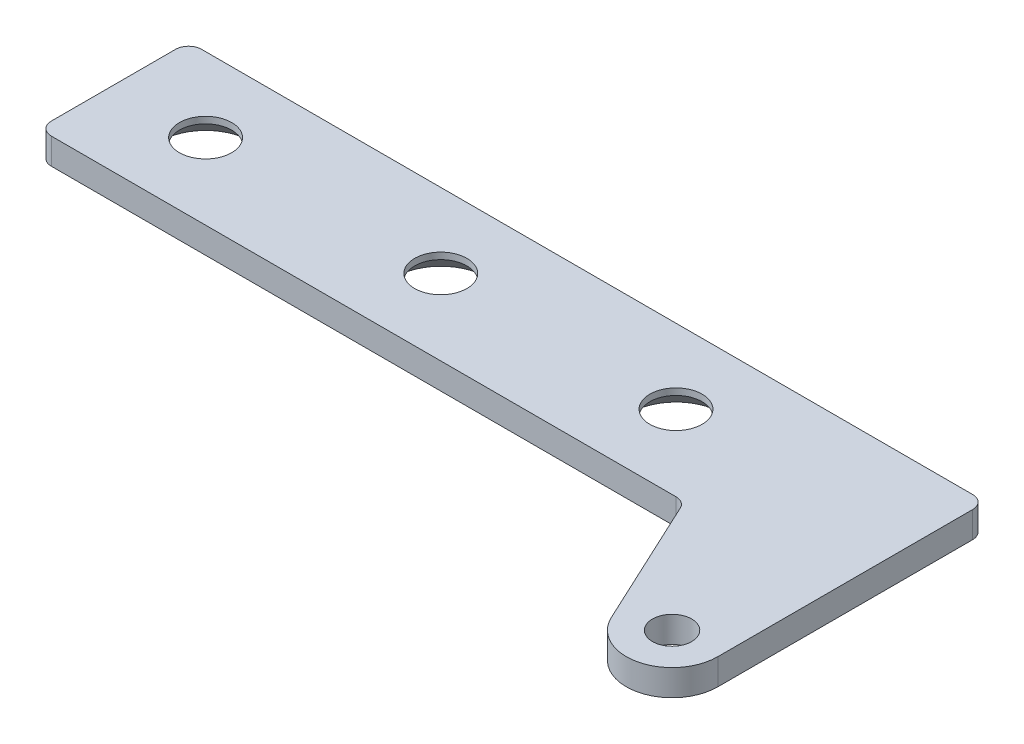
ISO-10303-21;
HEADER;
FILE_DESCRIPTION(('STEP AP214'),'2;1');
FILE_NAME('part.step','',(''),(''),'','','');
FILE_SCHEMA(('AUTOMOTIVE_DESIGN { 1 0 10303 214 1 1 1 1 }'));
ENDSEC;
DATA;
#1=APPLICATION_CONTEXT('core data for automotive mechanical design processes');
#2=APPLICATION_PROTOCOL_DEFINITION('international standard','automotive_design',2000,#1);
#3=PRODUCT_CONTEXT('',#1,'mechanical');
#4=PRODUCT('Part','Part','',(#3));
#5=PRODUCT_RELATED_PRODUCT_CATEGORY('part','',(#4));
#6=PRODUCT_DEFINITION_FORMATION('','',#4);
#7=PRODUCT_DEFINITION_CONTEXT('part definition',#1,'design');
#8=PRODUCT_DEFINITION('design','',#6,#7);
#9=PRODUCT_DEFINITION_SHAPE('','',#8);
#10=(LENGTH_UNIT() NAMED_UNIT(*) SI_UNIT(.MILLI.,.METRE.));
#11=(NAMED_UNIT(*) PLANE_ANGLE_UNIT() SI_UNIT($,.RADIAN.));
#12=(NAMED_UNIT(*) SI_UNIT($,.STERADIAN.) SOLID_ANGLE_UNIT());
#13=UNCERTAINTY_MEASURE_WITH_UNIT(LENGTH_MEASURE(1.E-05),#10,'distance_accuracy_value','');
#14=(GEOMETRIC_REPRESENTATION_CONTEXT(3) GLOBAL_UNCERTAINTY_ASSIGNED_CONTEXT((#13)) GLOBAL_UNIT_ASSIGNED_CONTEXT((#10,
#11,#12)) REPRESENTATION_CONTEXT('',''));
#15=CARTESIAN_POINT('',(0.,0.,0.));
#16=DIRECTION('',(0.,0.,1.));
#17=DIRECTION('',(1.,0.,0.));
#18=AXIS2_PLACEMENT_3D('',#15,#16,#17);
#19=CARTESIAN_POINT('',(0.,-2.,0.));
#20=DIRECTION('',(-1.,0.,0.));
#21=DIRECTION('',(0.,0.,-1.));
#22=AXIS2_PLACEMENT_3D('',#19,#20,#21);
#23=PLANE('',#22);
#24=DIRECTION('',(0.,0.,-1.));
#25=VECTOR('',#24,1.);
#26=CARTESIAN_POINT('',(0.,0.,0.));
#27=LINE('',#26,#25);
#28=CARTESIAN_POINT('',(0.,0.,10.5));
#29=VERTEX_POINT('',#28);
#30=CARTESIAN_POINT('',(0.,0.,1.));
#31=VERTEX_POINT('',#30);
#32=EDGE_CURVE('E146',#29,#31,#27,.T.);
#33=ORIENTED_EDGE('',*,*,#32,.T.);
#34=DIRECTION('',(0.,1.,0.));
#35=VECTOR('',#34,1.);
#36=CARTESIAN_POINT('',(0.,-2.,1.));
#37=LINE('',#36,#35);
#38=CARTESIAN_POINT('',(0.,-2.,1.));
#39=VERTEX_POINT('',#38);
#40=EDGE_CURVE('E176',#39,#31,#37,.T.);
#41=ORIENTED_EDGE('',*,*,#40,.F.);
#42=DIRECTION('',(0.,0.,-1.));
#43=VECTOR('',#42,1.);
#44=CARTESIAN_POINT('',(0.,-2.,0.));
#45=LINE('',#44,#43);
#46=CARTESIAN_POINT('',(0.,-2.,10.5));
#47=VERTEX_POINT('',#46);
#48=EDGE_CURVE('E162',#47,#39,#45,.T.);
#49=ORIENTED_EDGE('',*,*,#48,.F.);
#50=DIRECTION('',(0.,1.,0.));
#51=VECTOR('',#50,1.);
#52=CARTESIAN_POINT('',(0.,-2.,10.5));
#53=LINE('',#52,#51);
#54=EDGE_CURVE('E179',#29,#47,#53,.F.);
#55=ORIENTED_EDGE('',*,*,#54,.F.);
#56=EDGE_LOOP('',(#33,#41,#49,#55));
#57=FACE_BOUND('',#56,.T.);
#58=ADVANCED_FACE('F39',(#57),#23,.T.);
#59=CARTESIAN_POINT('',(0.,-2.,11.5));
#60=DIRECTION('',(0.,0.,1.));
#61=DIRECTION('',(-1.,0.,0.));
#62=AXIS2_PLACEMENT_3D('',#59,#60,#61);
#63=PLANE('',#62);
#64=DIRECTION('',(-1.,0.,0.));
#65=VECTOR('',#64,1.);
#66=CARTESIAN_POINT('',(0.,-2.,11.5));
#67=LINE('',#66,#65);
#68=CARTESIAN_POINT('',(48.8043380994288,-2.,11.5));
#69=VERTEX_POINT('',#68);
#70=CARTESIAN_POINT('',(1.,-2.,11.5));
#71=VERTEX_POINT('',#70);
#72=EDGE_CURVE('E134',#69,#71,#67,.T.);
#73=ORIENTED_EDGE('',*,*,#72,.F.);
#74=DIRECTION('',(0.,1.,0.));
#75=VECTOR('',#74,1.);
#76=CARTESIAN_POINT('',(48.8043380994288,-2.,11.5));
#77=LINE('',#76,#75);
#78=CARTESIAN_POINT('',(48.8043380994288,0.,11.5));
#79=VERTEX_POINT('',#78);
#80=EDGE_CURVE('E163',#79,#69,#77,.F.);
#81=ORIENTED_EDGE('',*,*,#80,.F.);
#82=DIRECTION('',(-1.,0.,0.));
#83=VECTOR('',#82,1.);
#84=CARTESIAN_POINT('',(0.,0.,11.5));
#85=LINE('',#84,#83);
#86=CARTESIAN_POINT('',(1.,0.,11.5));
#87=VERTEX_POINT('',#86);
#88=EDGE_CURVE('E159',#79,#87,#85,.T.);
#89=ORIENTED_EDGE('',*,*,#88,.T.);
#90=DIRECTION('',(0.,1.,0.));
#91=VECTOR('',#90,1.);
#92=CARTESIAN_POINT('',(1.,-2.,11.5));
#93=LINE('',#92,#91);
#94=EDGE_CURVE('E167',#71,#87,#93,.T.);
#95=ORIENTED_EDGE('',*,*,#94,.F.);
#96=EDGE_LOOP('',(#73,#81,#89,#95));
#97=FACE_BOUND('',#96,.T.);
#98=ADVANCED_FACE('F206',(#97),#63,.T.);
#99=CARTESIAN_POINT('',(49.4414083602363,-2.,11.5));
#100=DIRECTION('',(-0.906307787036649,0.,0.422618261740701));
#101=DIRECTION('',(-0.422618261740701,0.,-0.906307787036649));
#102=AXIS2_PLACEMENT_3D('',#99,#100,#101);
#103=PLANE('',#102);
#104=DIRECTION('',(-0.422618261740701,0.,-0.906307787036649));
#105=VECTOR('',#104,1.);
#106=CARTESIAN_POINT('',(49.4414083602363,-2.,11.5));
#107=LINE('',#106,#105);
#108=CARTESIAN_POINT('',(54.3279227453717,-2.,21.9791639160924));
#109=VERTEX_POINT('',#108);
#110=CARTESIAN_POINT('',(49.7106458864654,-2.,12.0773817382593));
#111=VERTEX_POINT('',#110);
#112=EDGE_CURVE('E139',#109,#111,#107,.T.);
#113=ORIENTED_EDGE('',*,*,#112,.F.);
#114=DIRECTION('',(0.,1.,0.));
#115=VECTOR('',#114,1.);
#116=CARTESIAN_POINT('',(54.3279227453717,-2.,21.9791639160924));
#117=LINE('',#116,#115);
#118=CARTESIAN_POINT('',(54.3279227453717,0.,21.9791639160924));
#119=VERTEX_POINT('',#118);
#120=EDGE_CURVE('E133',#109,#119,#117,.T.);
#121=ORIENTED_EDGE('',*,*,#120,.T.);
#122=DIRECTION('',(-0.422618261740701,0.,-0.906307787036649));
#123=VECTOR('',#122,1.);
#124=CARTESIAN_POINT('',(49.4414083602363,0.,11.5));
#125=LINE('',#124,#123);
#126=CARTESIAN_POINT('',(49.7106458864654,0.,12.0773817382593));
#127=VERTEX_POINT('',#126);
#128=EDGE_CURVE('E156',#119,#127,#125,.T.);
#129=ORIENTED_EDGE('',*,*,#128,.T.);
#130=DIRECTION('',(0.,1.,0.));
#131=VECTOR('',#130,1.);
#132=CARTESIAN_POINT('',(49.7106458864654,0.,12.0773817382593));
#133=LINE('',#132,#131);
#134=EDGE_CURVE('E186',#111,#127,#133,.T.);
#135=ORIENTED_EDGE('',*,*,#134,.F.);
#136=EDGE_LOOP('',(#113,#121,#129,#135));
#137=FACE_BOUND('',#136,.T.);
#138=ADVANCED_FACE('F208',(#137),#103,.T.);
#139=CARTESIAN_POINT('',(57.5,-2.,20.5));
#140=DIRECTION('',(0.,1.,0.));
#141=DIRECTION('',(0.,0.,-1.));
#142=AXIS2_PLACEMENT_3D('',#139,#140,#141);
#143=CYLINDRICAL_SURFACE('',#142,3.5);
#144=CARTESIAN_POINT('',(57.5,0.,20.5));
#145=DIRECTION('',(0.,-1.,0.));
#146=DIRECTION('',(0.,0.,1.));
#147=AXIS2_PLACEMENT_3D('',#144,#145,#146);
#148=CIRCLE('',#147,3.5);
#149=CARTESIAN_POINT('',(61.,0.,20.5));
#150=VERTEX_POINT('',#149);
#151=EDGE_CURVE('E154',#150,#119,#148,.T.);
#152=ORIENTED_EDGE('',*,*,#151,.T.);
#153=ORIENTED_EDGE('',*,*,#120,.F.);
#154=CARTESIAN_POINT('',(57.5,-2.,20.5));
#155=DIRECTION('',(0.,-1.,0.));
#156=DIRECTION('',(0.,0.,1.));
#157=AXIS2_PLACEMENT_3D('',#154,#155,#156);
#158=CIRCLE('',#157,3.5);
#159=CARTESIAN_POINT('',(61.,-2.,20.5));
#160=VERTEX_POINT('',#159);
#161=EDGE_CURVE('E120',#160,#109,#158,.T.);
#162=ORIENTED_EDGE('',*,*,#161,.F.);
#163=DIRECTION('',(0.,1.,0.));
#164=VECTOR('',#163,1.);
#165=CARTESIAN_POINT('',(61.,-2.,20.5));
#166=LINE('',#165,#164);
#167=EDGE_CURVE('E127',#160,#150,#166,.T.);
#168=ORIENTED_EDGE('',*,*,#167,.T.);
#169=EDGE_LOOP('',(#152,#153,#162,#168));
#170=FACE_BOUND('',#169,.T.);
#171=ADVANCED_FACE('F136',(#170),#143,.T.);
#172=CARTESIAN_POINT('',(61.,-2.,0.));
#173=DIRECTION('',(1.,0.,0.));
#174=DIRECTION('',(0.,0.,1.));
#175=AXIS2_PLACEMENT_3D('',#172,#173,#174);
#176=PLANE('',#175);
#177=DIRECTION('',(0.,0.,1.));
#178=VECTOR('',#177,1.);
#179=CARTESIAN_POINT('',(61.,0.,0.));
#180=LINE('',#179,#178);
#181=CARTESIAN_POINT('',(61.,0.,1.));
#182=VERTEX_POINT('',#181);
#183=EDGE_CURVE('E130',#182,#150,#180,.T.);
#184=ORIENTED_EDGE('',*,*,#183,.T.);
#185=ORIENTED_EDGE('',*,*,#167,.F.);
#186=DIRECTION('',(0.,0.,1.));
#187=VECTOR('',#186,1.);
#188=CARTESIAN_POINT('',(61.,-2.,0.));
#189=LINE('',#188,#187);
#190=CARTESIAN_POINT('',(61.,-2.,1.));
#191=VERTEX_POINT('',#190);
#192=EDGE_CURVE('E115',#191,#160,#189,.T.);
#193=ORIENTED_EDGE('',*,*,#192,.F.);
#194=DIRECTION('',(0.,1.,0.));
#195=VECTOR('',#194,1.);
#196=CARTESIAN_POINT('',(61.,-2.,1.));
#197=LINE('',#196,#195);
#198=EDGE_CURVE('E193',#182,#191,#197,.F.);
#199=ORIENTED_EDGE('',*,*,#198,.F.);
#200=EDGE_LOOP('',(#184,#185,#193,#199));
#201=FACE_BOUND('',#200,.T.);
#202=ADVANCED_FACE('F128',(#201),#176,.T.);
#203=CARTESIAN_POINT('',(0.,-2.,0.));
#204=DIRECTION('',(0.,0.,-1.));
#205=DIRECTION('',(1.,0.,0.));
#206=AXIS2_PLACEMENT_3D('',#203,#204,#205);
#207=PLANE('',#206);
#208=DIRECTION('',(1.,0.,0.));
#209=VECTOR('',#208,1.);
#210=CARTESIAN_POINT('',(0.,-2.,0.));
#211=LINE('',#210,#209);
#212=CARTESIAN_POINT('',(1.,-2.,0.));
#213=VERTEX_POINT('',#212);
#214=CARTESIAN_POINT('',(60.,-2.,0.));
#215=VERTEX_POINT('',#214);
#216=EDGE_CURVE('E124',#213,#215,#211,.T.);
#217=ORIENTED_EDGE('',*,*,#216,.F.);
#218=DIRECTION('',(0.,1.,0.));
#219=VECTOR('',#218,1.);
#220=CARTESIAN_POINT('',(1.,-2.,0.));
#221=LINE('',#220,#219);
#222=CARTESIAN_POINT('',(1.,0.,0.));
#223=VERTEX_POINT('',#222);
#224=EDGE_CURVE('E189',#223,#213,#221,.F.);
#225=ORIENTED_EDGE('',*,*,#224,.F.);
#226=DIRECTION('',(1.,0.,0.));
#227=VECTOR('',#226,1.);
#228=CARTESIAN_POINT('',(0.,0.,0.));
#229=LINE('',#228,#227);
#230=CARTESIAN_POINT('',(60.,0.,0.));
#231=VERTEX_POINT('',#230);
#232=EDGE_CURVE('E149',#223,#231,#229,.T.);
#233=ORIENTED_EDGE('',*,*,#232,.T.);
#234=DIRECTION('',(0.,1.,0.));
#235=VECTOR('',#234,1.);
#236=CARTESIAN_POINT('',(60.,-2.,0.));
#237=LINE('',#236,#235);
#238=EDGE_CURVE('E191',#215,#231,#237,.T.);
#239=ORIENTED_EDGE('',*,*,#238,.F.);
#240=EDGE_LOOP('',(#217,#225,#233,#239));
#241=FACE_BOUND('',#240,.T.);
#242=ADVANCED_FACE('F214',(#241),#207,.T.);
#243=CARTESIAN_POINT('',(57.5,-2.,20.5));
#244=DIRECTION('',(0.,-1.,0.));
#245=DIRECTION('',(0.,0.,1.));
#246=AXIS2_PLACEMENT_3D('',#243,#244,#245);
#247=PLANE('',#246);
#248=CARTESIAN_POINT('',(57.5,-2.,20.5));
#249=DIRECTION('',(0.,-1.,0.));
#250=DIRECTION('',(0.,0.,-1.));
#251=AXIS2_PLACEMENT_3D('',#248,#249,#250);
#252=CIRCLE('',#251,1.5);
#253=CARTESIAN_POINT('',(57.5,-2.,19.));
#254=VERTEX_POINT('',#253);
#255=EDGE_CURVE('E281',#254,#254,#252,.T.);
#256=ORIENTED_EDGE('',*,*,#255,.F.);
#257=EDGE_LOOP('',(#256));
#258=FACE_BOUND('',#257,.T.);
#259=CARTESIAN_POINT('',(7.,-2.,5.7));
#260=DIRECTION('',(0.,1.,0.));
#261=DIRECTION('',(0.,0.,1.));
#262=AXIS2_PLACEMENT_3D('',#259,#260,#261);
#263=CIRCLE('',#262,3.5);
#264=CARTESIAN_POINT('',(7.,-2.,9.2));
#265=VERTEX_POINT('',#264);
#266=EDGE_CURVE('E286',#265,#265,#263,.T.);
#267=ORIENTED_EDGE('',*,*,#266,.T.);
#268=EDGE_LOOP('',(#267));
#269=FACE_BOUND('',#268,.T.);
#270=CARTESIAN_POINT('',(25.,-2.,5.7));
#271=DIRECTION('',(0.,1.,0.));
#272=DIRECTION('',(0.,0.,1.));
#273=AXIS2_PLACEMENT_3D('',#270,#271,#272);
#274=CIRCLE('',#273,3.5);
#275=CARTESIAN_POINT('',(25.,-2.,9.2));
#276=VERTEX_POINT('',#275);
#277=EDGE_CURVE('E297',#276,#276,#274,.T.);
#278=ORIENTED_EDGE('',*,*,#277,.T.);
#279=EDGE_LOOP('',(#278));
#280=FACE_BOUND('',#279,.T.);
#281=CARTESIAN_POINT('',(43.,-2.,5.7));
#282=DIRECTION('',(0.,1.,0.));
#283=DIRECTION('',(0.,0.,1.));
#284=AXIS2_PLACEMENT_3D('',#281,#282,#283);
#285=CIRCLE('',#284,3.5);
#286=CARTESIAN_POINT('',(43.,-2.,9.2));
#287=VERTEX_POINT('',#286);
#288=EDGE_CURVE('E306',#287,#287,#285,.T.);
#289=ORIENTED_EDGE('',*,*,#288,.T.);
#290=EDGE_LOOP('',(#289));
#291=FACE_BOUND('',#290,.T.);
#292=ORIENTED_EDGE('',*,*,#48,.T.);
#293=CARTESIAN_POINT('',(1.,-2.,1.));
#294=DIRECTION('',(0.,1.,0.));
#295=DIRECTION('',(0.,0.,1.));
#296=AXIS2_PLACEMENT_3D('',#293,#294,#295);
#297=CIRCLE('',#296,1.);
#298=EDGE_CURVE('E62',#213,#39,#297,.T.);
#299=ORIENTED_EDGE('',*,*,#298,.F.);
#300=ORIENTED_EDGE('',*,*,#216,.T.);
#301=CARTESIAN_POINT('',(60.,-2.,1.));
#302=DIRECTION('',(0.,1.,0.));
#303=DIRECTION('',(0.,0.,1.));
#304=AXIS2_PLACEMENT_3D('',#301,#302,#303);
#305=CIRCLE('',#304,1.);
#306=EDGE_CURVE('E54',#191,#215,#305,.T.);
#307=ORIENTED_EDGE('',*,*,#306,.F.);
#308=ORIENTED_EDGE('',*,*,#192,.T.);
#309=ORIENTED_EDGE('',*,*,#161,.T.);
#310=ORIENTED_EDGE('',*,*,#112,.T.);
#311=CARTESIAN_POINT('',(48.8043380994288,-2.,12.5));
#312=DIRECTION('',(0.,1.,0.));
#313=DIRECTION('',(0.,0.,1.));
#314=AXIS2_PLACEMENT_3D('',#311,#312,#313);
#315=CIRCLE('',#314,1.);
#316=EDGE_CURVE('E11',#69,#111,#315,.F.);
#317=ORIENTED_EDGE('',*,*,#316,.F.);
#318=ORIENTED_EDGE('',*,*,#72,.T.);
#319=CARTESIAN_POINT('',(1.,-2.,10.5));
#320=DIRECTION('',(0.,1.,0.));
#321=DIRECTION('',(0.,0.,1.));
#322=AXIS2_PLACEMENT_3D('',#319,#320,#321);
#323=CIRCLE('',#322,1.);
#324=EDGE_CURVE('E184',#47,#71,#323,.T.);
#325=ORIENTED_EDGE('',*,*,#324,.F.);
#326=EDGE_LOOP('',(#292,#299,#300,#307,#308,#309,#310,#317,#318,#325));
#327=FACE_BOUND('',#326,.T.);
#328=ADVANCED_FACE('F117',(#258,#269,#280,#291,#327),#247,.T.);
#329=CARTESIAN_POINT('',(57.5,0.,20.5));
#330=DIRECTION('',(0.,-1.,0.));
#331=DIRECTION('',(0.,0.,1.));
#332=AXIS2_PLACEMENT_3D('',#329,#330,#331);
#333=PLANE('',#332);
#334=CARTESIAN_POINT('',(57.5,0.,20.5));
#335=DIRECTION('',(0.,-1.,0.));
#336=DIRECTION('',(0.,0.,-1.));
#337=AXIS2_PLACEMENT_3D('',#334,#335,#336);
#338=CIRCLE('',#337,1.5);
#339=CARTESIAN_POINT('',(57.5,0.,19.));
#340=VERTEX_POINT('',#339);
#341=EDGE_CURVE('E284',#340,#340,#338,.T.);
#342=ORIENTED_EDGE('',*,*,#341,.T.);
#343=EDGE_LOOP('',(#342));
#344=FACE_BOUND('',#343,.T.);
#345=CARTESIAN_POINT('',(7.,0.,5.7));
#346=DIRECTION('',(0.,1.,0.));
#347=DIRECTION('',(0.,0.,1.));
#348=AXIS2_PLACEMENT_3D('',#345,#346,#347);
#349=CIRCLE('',#348,2.);
#350=CARTESIAN_POINT('',(7.,0.,7.7));
#351=VERTEX_POINT('',#350);
#352=EDGE_CURVE('E294',#351,#351,#349,.T.);
#353=ORIENTED_EDGE('',*,*,#352,.F.);
#354=EDGE_LOOP('',(#353));
#355=FACE_BOUND('',#354,.T.);
#356=CARTESIAN_POINT('',(25.,0.,5.7));
#357=DIRECTION('',(0.,1.,0.));
#358=DIRECTION('',(0.,0.,1.));
#359=AXIS2_PLACEMENT_3D('',#356,#357,#358);
#360=CIRCLE('',#359,2.);
#361=CARTESIAN_POINT('',(25.,0.,7.7));
#362=VERTEX_POINT('',#361);
#363=EDGE_CURVE('E303',#362,#362,#360,.T.);
#364=ORIENTED_EDGE('',*,*,#363,.F.);
#365=EDGE_LOOP('',(#364));
#366=FACE_BOUND('',#365,.T.);
#367=CARTESIAN_POINT('',(43.,0.,5.7));
#368=DIRECTION('',(0.,1.,0.));
#369=DIRECTION('',(0.,0.,1.));
#370=AXIS2_PLACEMENT_3D('',#367,#368,#369);
#371=CIRCLE('',#370,2.);
#372=CARTESIAN_POINT('',(43.,0.,7.7));
#373=VERTEX_POINT('',#372);
#374=EDGE_CURVE('E150',#373,#373,#371,.T.);
#375=ORIENTED_EDGE('',*,*,#374,.F.);
#376=EDGE_LOOP('',(#375));
#377=FACE_BOUND('',#376,.T.);
#378=ORIENTED_EDGE('',*,*,#88,.F.);
#379=CARTESIAN_POINT('',(48.8043380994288,0.,12.5));
#380=DIRECTION('',(0.,1.,0.));
#381=DIRECTION('',(0.,0.,1.));
#382=AXIS2_PLACEMENT_3D('',#379,#380,#381);
#383=CIRCLE('',#382,1.);
#384=EDGE_CURVE('E47',#127,#79,#383,.T.);
#385=ORIENTED_EDGE('',*,*,#384,.F.);
#386=ORIENTED_EDGE('',*,*,#128,.F.);
#387=ORIENTED_EDGE('',*,*,#151,.F.);
#388=ORIENTED_EDGE('',*,*,#183,.F.);
#389=CARTESIAN_POINT('',(60.,0.,1.));
#390=DIRECTION('',(0.,1.,0.));
#391=DIRECTION('',(0.,0.,1.));
#392=AXIS2_PLACEMENT_3D('',#389,#390,#391);
#393=CIRCLE('',#392,1.);
#394=EDGE_CURVE('E172',#231,#182,#393,.F.);
#395=ORIENTED_EDGE('',*,*,#394,.F.);
#396=ORIENTED_EDGE('',*,*,#232,.F.);
#397=CARTESIAN_POINT('',(1.,0.,1.));
#398=DIRECTION('',(0.,1.,0.));
#399=DIRECTION('',(0.,0.,1.));
#400=AXIS2_PLACEMENT_3D('',#397,#398,#399);
#401=CIRCLE('',#400,1.);
#402=EDGE_CURVE('E170',#31,#223,#401,.F.);
#403=ORIENTED_EDGE('',*,*,#402,.F.);
#404=ORIENTED_EDGE('',*,*,#32,.F.);
#405=CARTESIAN_POINT('',(1.,0.,10.5));
#406=DIRECTION('',(0.,1.,0.));
#407=DIRECTION('',(0.,0.,1.));
#408=AXIS2_PLACEMENT_3D('',#405,#406,#407);
#409=CIRCLE('',#408,1.);
#410=EDGE_CURVE('E174',#87,#29,#409,.F.);
#411=ORIENTED_EDGE('',*,*,#410,.F.);
#412=EDGE_LOOP('',(#378,#385,#386,#387,#388,#395,#396,#403,#404,#411));
#413=FACE_BOUND('',#412,.T.);
#414=ADVANCED_FACE('F202',(#344,#355,#366,#377,#413),#333,.F.);
#415=CARTESIAN_POINT('',(1.,-2.,10.5));
#416=DIRECTION('',(0.,1.,0.));
#417=DIRECTION('',(0.,0.,-1.));
#418=AXIS2_PLACEMENT_3D('',#415,#416,#417);
#419=CYLINDRICAL_SURFACE('',#418,1.);
#420=ORIENTED_EDGE('',*,*,#324,.T.);
#421=ORIENTED_EDGE('',*,*,#94,.T.);
#422=ORIENTED_EDGE('',*,*,#410,.T.);
#423=ORIENTED_EDGE('',*,*,#54,.T.);
#424=EDGE_LOOP('',(#420,#421,#422,#423));
#425=FACE_BOUND('',#424,.T.);
#426=ADVANCED_FACE('F221',(#425),#419,.T.);
#427=CARTESIAN_POINT('',(48.8043380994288,-2.,12.5));
#428=DIRECTION('',(0.,-1.,0.));
#429=DIRECTION('',(0.,0.,1.));
#430=AXIS2_PLACEMENT_3D('',#427,#428,#429);
#431=CYLINDRICAL_SURFACE('',#430,1.);
#432=ORIENTED_EDGE('',*,*,#316,.T.);
#433=ORIENTED_EDGE('',*,*,#134,.T.);
#434=ORIENTED_EDGE('',*,*,#384,.T.);
#435=ORIENTED_EDGE('',*,*,#80,.T.);
#436=EDGE_LOOP('',(#432,#433,#434,#435));
#437=FACE_BOUND('',#436,.T.);
#438=ADVANCED_FACE('F196',(#437),#431,.F.);
#439=CARTESIAN_POINT('',(60.,-2.,1.));
#440=DIRECTION('',(0.,1.,0.));
#441=DIRECTION('',(0.,0.,-1.));
#442=AXIS2_PLACEMENT_3D('',#439,#440,#441);
#443=CYLINDRICAL_SURFACE('',#442,1.);
#444=ORIENTED_EDGE('',*,*,#306,.T.);
#445=ORIENTED_EDGE('',*,*,#238,.T.);
#446=ORIENTED_EDGE('',*,*,#394,.T.);
#447=ORIENTED_EDGE('',*,*,#198,.T.);
#448=EDGE_LOOP('',(#444,#445,#446,#447));
#449=FACE_BOUND('',#448,.T.);
#450=ADVANCED_FACE('F211',(#449),#443,.T.);
#451=CARTESIAN_POINT('',(1.,-2.,1.));
#452=DIRECTION('',(0.,1.,0.));
#453=DIRECTION('',(0.,0.,-1.));
#454=AXIS2_PLACEMENT_3D('',#451,#452,#453);
#455=CYLINDRICAL_SURFACE('',#454,1.);
#456=ORIENTED_EDGE('',*,*,#298,.T.);
#457=ORIENTED_EDGE('',*,*,#40,.T.);
#458=ORIENTED_EDGE('',*,*,#402,.T.);
#459=ORIENTED_EDGE('',*,*,#224,.T.);
#460=EDGE_LOOP('',(#456,#457,#458,#459));
#461=FACE_BOUND('',#460,.T.);
#462=ADVANCED_FACE('F41',(#461),#455,.T.);
#463=CARTESIAN_POINT('',(43.,-2.,5.7));
#464=DIRECTION('',(0.,-1.,0.));
#465=DIRECTION('',(0.,0.,1.));
#466=AXIS2_PLACEMENT_3D('',#463,#464,#465);
#467=CYLINDRICAL_SURFACE('',#466,2.);
#468=ORIENTED_EDGE('',*,*,#374,.T.);
#469=EDGE_LOOP('',(#468));
#470=FACE_BOUND('',#469,.T.);
#471=CARTESIAN_POINT('',(43.,-0.500000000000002,5.7));
#472=DIRECTION('',(0.,1.,0.));
#473=DIRECTION('',(0.,0.,1.));
#474=AXIS2_PLACEMENT_3D('',#471,#472,#473);
#475=CIRCLE('',#474,2.);
#476=CARTESIAN_POINT('',(43.,-0.500000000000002,7.7));
#477=VERTEX_POINT('',#476);
#478=EDGE_CURVE('E309',#477,#477,#475,.T.);
#479=ORIENTED_EDGE('',*,*,#478,.F.);
#480=EDGE_LOOP('',(#479));
#481=FACE_BOUND('',#480,.T.);
#482=ADVANCED_FACE('F249',(#470,#481),#467,.F.);
#483=CARTESIAN_POINT('',(43.,-2.,5.7));
#484=DIRECTION('',(0.,-1.,0.));
#485=DIRECTION('',(0.,0.,1.));
#486=AXIS2_PLACEMENT_3D('',#483,#484,#485);
#487=CONICAL_SURFACE('',#486,3.5,0.785398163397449);
#488=ORIENTED_EDGE('',*,*,#478,.T.);
#489=EDGE_LOOP('',(#488));
#490=FACE_BOUND('',#489,.T.);
#491=ORIENTED_EDGE('',*,*,#288,.F.);
#492=EDGE_LOOP('',(#491));
#493=FACE_BOUND('',#492,.T.);
#494=ADVANCED_FACE('F252',(#490,#493),#487,.F.);
#495=CARTESIAN_POINT('',(25.,-2.,5.7));
#496=DIRECTION('',(0.,-1.,0.));
#497=DIRECTION('',(0.,0.,1.));
#498=AXIS2_PLACEMENT_3D('',#495,#496,#497);
#499=CYLINDRICAL_SURFACE('',#498,2.);
#500=ORIENTED_EDGE('',*,*,#363,.T.);
#501=EDGE_LOOP('',(#500));
#502=FACE_BOUND('',#501,.T.);
#503=CARTESIAN_POINT('',(25.,-0.500000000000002,5.7));
#504=DIRECTION('',(0.,1.,0.));
#505=DIRECTION('',(0.,0.,1.));
#506=AXIS2_PLACEMENT_3D('',#503,#504,#505);
#507=CIRCLE('',#506,2.);
#508=CARTESIAN_POINT('',(25.,-0.500000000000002,7.7));
#509=VERTEX_POINT('',#508);
#510=EDGE_CURVE('E300',#509,#509,#507,.T.);
#511=ORIENTED_EDGE('',*,*,#510,.F.);
#512=EDGE_LOOP('',(#511));
#513=FACE_BOUND('',#512,.T.);
#514=ADVANCED_FACE('F256',(#502,#513),#499,.F.);
#515=CARTESIAN_POINT('',(25.,-2.,5.7));
#516=DIRECTION('',(0.,-1.,0.));
#517=DIRECTION('',(0.,0.,1.));
#518=AXIS2_PLACEMENT_3D('',#515,#516,#517);
#519=CONICAL_SURFACE('',#518,3.5,0.785398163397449);
#520=ORIENTED_EDGE('',*,*,#510,.T.);
#521=EDGE_LOOP('',(#520));
#522=FACE_BOUND('',#521,.T.);
#523=ORIENTED_EDGE('',*,*,#277,.F.);
#524=EDGE_LOOP('',(#523));
#525=FACE_BOUND('',#524,.T.);
#526=ADVANCED_FACE('F260',(#522,#525),#519,.F.);
#527=CARTESIAN_POINT('',(7.,-2.,5.7));
#528=DIRECTION('',(0.,-1.,0.));
#529=DIRECTION('',(0.,0.,1.));
#530=AXIS2_PLACEMENT_3D('',#527,#528,#529);
#531=CYLINDRICAL_SURFACE('',#530,2.);
#532=ORIENTED_EDGE('',*,*,#352,.T.);
#533=EDGE_LOOP('',(#532));
#534=FACE_BOUND('',#533,.T.);
#535=CARTESIAN_POINT('',(7.,-0.500000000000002,5.7));
#536=DIRECTION('',(0.,1.,0.));
#537=DIRECTION('',(0.,0.,1.));
#538=AXIS2_PLACEMENT_3D('',#535,#536,#537);
#539=CIRCLE('',#538,2.);
#540=CARTESIAN_POINT('',(7.,-0.500000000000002,7.7));
#541=VERTEX_POINT('',#540);
#542=EDGE_CURVE('E291',#541,#541,#539,.T.);
#543=ORIENTED_EDGE('',*,*,#542,.F.);
#544=EDGE_LOOP('',(#543));
#545=FACE_BOUND('',#544,.T.);
#546=ADVANCED_FACE('F264',(#534,#545),#531,.F.);
#547=CARTESIAN_POINT('',(7.,-2.,5.7));
#548=DIRECTION('',(0.,-1.,0.));
#549=DIRECTION('',(0.,0.,1.));
#550=AXIS2_PLACEMENT_3D('',#547,#548,#549);
#551=CONICAL_SURFACE('',#550,3.5,0.785398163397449);
#552=ORIENTED_EDGE('',*,*,#542,.T.);
#553=EDGE_LOOP('',(#552));
#554=FACE_BOUND('',#553,.T.);
#555=ORIENTED_EDGE('',*,*,#266,.F.);
#556=EDGE_LOOP('',(#555));
#557=FACE_BOUND('',#556,.T.);
#558=ADVANCED_FACE('F268',(#554,#557),#551,.F.);
#559=CARTESIAN_POINT('',(57.5,-2.,20.5));
#560=DIRECTION('',(0.,1.,0.));
#561=DIRECTION('',(0.,0.,-1.));
#562=AXIS2_PLACEMENT_3D('',#559,#560,#561);
#563=CYLINDRICAL_SURFACE('',#562,1.5);
#564=ORIENTED_EDGE('',*,*,#255,.T.);
#565=EDGE_LOOP('',(#564));
#566=FACE_BOUND('',#565,.T.);
#567=ORIENTED_EDGE('',*,*,#341,.F.);
#568=EDGE_LOOP('',(#567));
#569=FACE_BOUND('',#568,.T.);
#570=ADVANCED_FACE('F272',(#566,#569),#563,.F.);
#571=CLOSED_SHELL('',(#58,#98,#138,#171,#202,#242,#328,#414,#426,#438,#450,#462,#482,#494,#514,
#526,#546,#558,#570));
#572=MANIFOLD_SOLID_BREP('B2',#571);
#573=ADVANCED_BREP_SHAPE_REPRESENTATION('',(#18,#572),#14);
#574=SHAPE_DEFINITION_REPRESENTATION(#9,#573);
ENDSEC;
END-ISO-10303-21;
